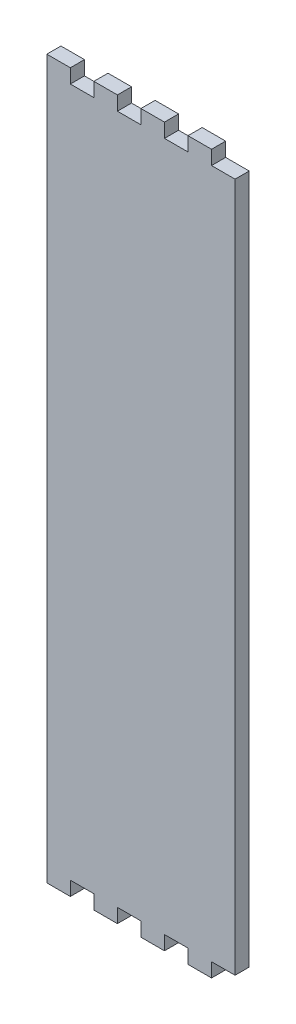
from build123d import *

# Parameters (mm, degrees)
ESTRUSIONE_ESTRUSIONE1_DEPTH = 6


with BuildPart() as part:
    # Schizzo1 → Estrusione-Estrusione1 (new body)
    with BuildSketch(Plane.XY):
        Polygon((-40, 152.5), (-30, 152.5), (-30, 146.5), (-20, 146.5), (-20, 152.5), (-10, 152.5), (-10, 146.5), (0, 146.5), (0, 152.5), (10, 152.5), (10, 146.5), (20, 146.5), (20, 152.5), (30, 152.5), (30, 146.5), (40, 146.5), (40, -146.5), (30, -146.5), (30, -152.5), (20, -152.5), (20, -146.5), (10, -146.5), (10, -152.5), (0, -152.5), (0, -146.5), (-10, -146.5), (-10, -152.5), (-20, -152.5), (-20, -146.5), (-30, -146.5), (-30, -152.5), (-40, -152.5), align=None)
    extrude(amount=ESTRUSIONE_ESTRUSIONE1_DEPTH)


solid = part.part
